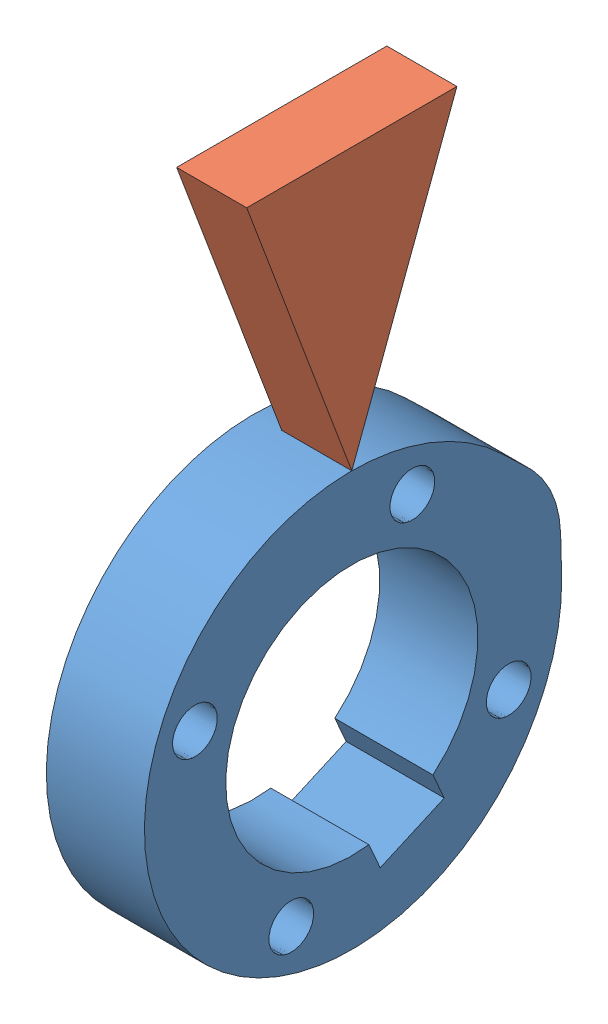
SolidWorks assembly KinematikSimu.SLDASM, configuration Standard (file format 5000). Lengths in mm.
Overall size (14 114.07 84.37).
2 component instances, 2 part files, 7 mates.
Components (placement in the parent):
- nocken_ohne-2: nocken_ohne.SLDPRT [Standard] at (-14 18 18) x (0 -0.914256 -0.405136) z (1 0 0) size (71.05 60.8 14)
- drei-1: drei.SLDPRT [Standard] at (-10 47.602 18) x (0 0 -1) z (1 0 0) size (30 40 10)
Mates (geometry in assembly coordinates):
- Tangential2: tangent: cylinder of nocken_ohne-2 through (0 18 18) axis (-1 0 0) radius 18; plane of assembly through (0 0 0) normal (0 1 0)
- Tangential3: tangent: cylinder of nocken_ohne-2 through (0 18 18) axis (-1 0 0) radius 18; plane of assembly through (0 0 0) normal (0 0 1)
- Deckungsgleich3: coincident: plane of nocken_ohne-2 through (0 18 18) normal (1 0 0); plane of assembly through (0 0 0) normal (1 0 0)
- Deckungsgleich5: coincident: plane of drei-1 through (0 47.6282 18) normal (1 0 0); plane of assembly through (0 0 0) normal (1 0 0)
- Parallel3: parallel: plane of drei-1 through (0 87.6282 33) normal (0 1 0); plane of assembly through (0 0 0) normal (0 1 0)
- BahnVerknüpfung6: path: point of drei-1; curve of nocken_ohne-2
- Deckungsgleich7: coincident: plane of drei-1 through (-10 47.6282 18) normal (0 0 -1); plane of assembly through (0 0 18) normal (0 0 1)
